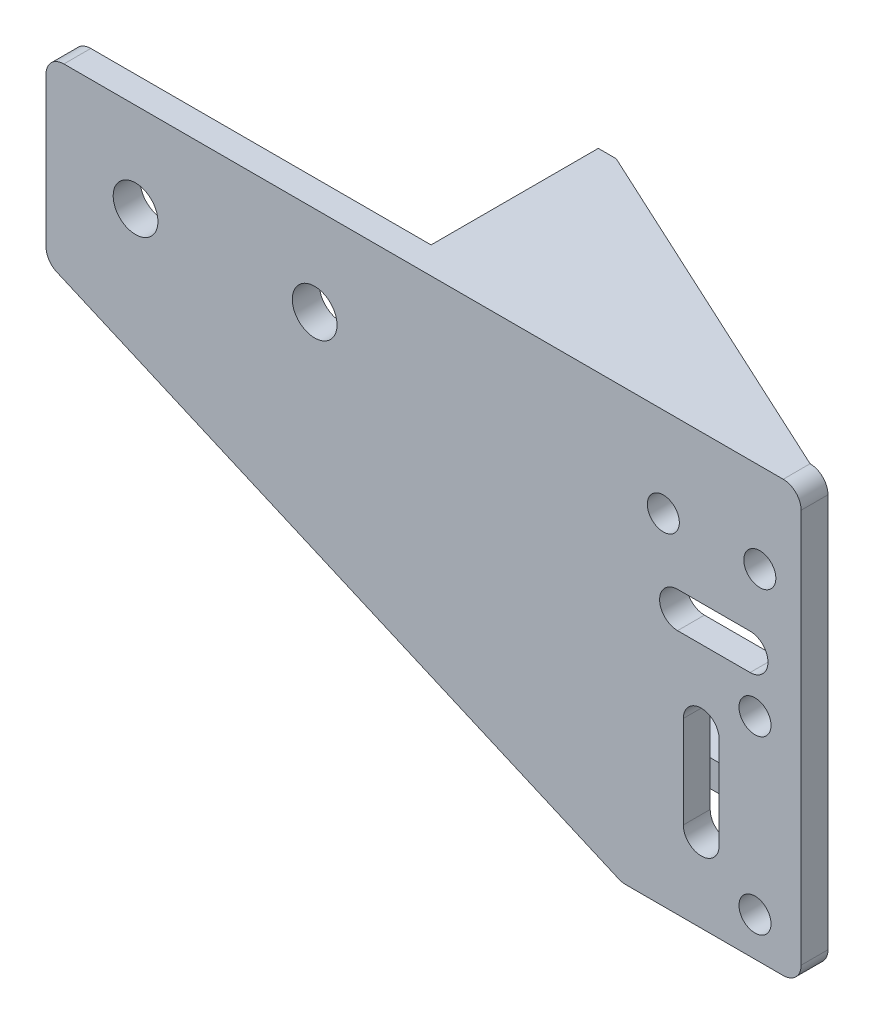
ISO-10303-21;
HEADER;
FILE_DESCRIPTION(('STEP AP214'),'2;1');
FILE_NAME('part.step','',(''),(''),'','','');
FILE_SCHEMA(('AUTOMOTIVE_DESIGN { 1 0 10303 214 1 1 1 1 }'));
ENDSEC;
DATA;
#1=APPLICATION_CONTEXT('core data for automotive mechanical design processes');
#2=APPLICATION_PROTOCOL_DEFINITION('international standard','automotive_design',2000,#1);
#3=PRODUCT_CONTEXT('',#1,'mechanical');
#4=PRODUCT('Part','Part','',(#3));
#5=PRODUCT_RELATED_PRODUCT_CATEGORY('part','',(#4));
#6=PRODUCT_DEFINITION_FORMATION('','',#4);
#7=PRODUCT_DEFINITION_CONTEXT('part definition',#1,'design');
#8=PRODUCT_DEFINITION('design','',#6,#7);
#9=PRODUCT_DEFINITION_SHAPE('','',#8);
#10=(LENGTH_UNIT() NAMED_UNIT(*) SI_UNIT(.MILLI.,.METRE.));
#11=(NAMED_UNIT(*) PLANE_ANGLE_UNIT() SI_UNIT($,.RADIAN.));
#12=(NAMED_UNIT(*) SI_UNIT($,.STERADIAN.) SOLID_ANGLE_UNIT());
#13=UNCERTAINTY_MEASURE_WITH_UNIT(LENGTH_MEASURE(1.E-05),#10,'distance_accuracy_value','');
#14=(GEOMETRIC_REPRESENTATION_CONTEXT(3) GLOBAL_UNCERTAINTY_ASSIGNED_CONTEXT((#13)) GLOBAL_UNIT_ASSIGNED_CONTEXT((#10,
#11,#12)) REPRESENTATION_CONTEXT('',''));
#15=CARTESIAN_POINT('',(0.,0.,0.));
#16=DIRECTION('',(0.,0.,1.));
#17=DIRECTION('',(1.,0.,0.));
#18=AXIS2_PLACEMENT_3D('',#15,#16,#17);
#19=CARTESIAN_POINT('',(11.0000000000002,212.9125,-10.));
#20=DIRECTION('',(1.,0.,0.));
#21=DIRECTION('',(0.,0.,-1.));
#22=AXIS2_PLACEMENT_3D('',#19,#20,#21);
#23=CYLINDRICAL_SURFACE('',#22,2.5);
#24=CARTESIAN_POINT('',(20.,212.9125,-10.));
#25=DIRECTION('',(1.,0.,0.));
#26=DIRECTION('',(0.,0.,-1.));
#27=AXIS2_PLACEMENT_3D('',#24,#25,#26);
#28=CIRCLE('',#27,2.5);
#29=CARTESIAN_POINT('',(20.,212.9125,-12.5));
#30=VERTEX_POINT('',#29);
#31=EDGE_CURVE('E159',#30,#30,#28,.T.);
#32=ORIENTED_EDGE('',*,*,#31,.F.);
#33=EDGE_LOOP('',(#32));
#34=FACE_BOUND('',#33,.T.);
#35=CARTESIAN_POINT('',(22.,212.9125,-10.));
#36=DIRECTION('',(1.,0.,0.));
#37=DIRECTION('',(0.,0.,-1.));
#38=AXIS2_PLACEMENT_3D('',#35,#36,#37);
#39=CIRCLE('',#38,2.5);
#40=CARTESIAN_POINT('',(22.,212.9125,-12.5));
#41=VERTEX_POINT('',#40);
#42=EDGE_CURVE('E20',#41,#41,#39,.T.);
#43=ORIENTED_EDGE('',*,*,#42,.T.);
#44=EDGE_LOOP('',(#43));
#45=FACE_BOUND('',#44,.T.);
#46=ADVANCED_FACE('F17',(#34,#45),#23,.F.);
#47=CARTESIAN_POINT('',(0.,197.4125,0.));
#48=DIRECTION('',(0.,1.,0.));
#49=DIRECTION('',(0.,0.,1.));
#50=AXIS2_PLACEMENT_3D('',#47,#48,#49);
#51=PLANE('',#50);
#52=DIRECTION('',(-1.,0.,0.));
#53=VECTOR('',#52,1.);
#54=CARTESIAN_POINT('',(0.,197.4125,0.));
#55=LINE('',#54,#53);
#56=CARTESIAN_POINT('',(51.1699999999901,197.4125,0.));
#57=VERTEX_POINT('',#56);
#58=CARTESIAN_POINT('',(55.1699999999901,197.4125,0.));
#59=VERTEX_POINT('',#58);
#60=EDGE_CURVE('E288',#57,#59,#55,.F.);
#61=ORIENTED_EDGE('',*,*,#60,.T.);
#62=DIRECTION('',(1.,0.,0.));
#63=VECTOR('',#62,1.);
#64=CARTESIAN_POINT('',(0.,197.4125,0.));
#65=LINE('',#64,#63);
#66=CARTESIAN_POINT('',(62.3249999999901,197.4125,0.));
#67=VERTEX_POINT('',#66);
#68=EDGE_CURVE('E298',#59,#67,#65,.T.);
#69=ORIENTED_EDGE('',*,*,#68,.T.);
#70=DIRECTION('',(-0.90742527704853,0.,-0.420213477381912));
#71=VECTOR('',#70,1.);
#72=CARTESIAN_POINT('',(11.0053090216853,197.4125,-23.7652910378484));
#73=LINE('',#72,#71);
#74=CARTESIAN_POINT('',(22.,197.4125,-18.6738334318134));
#75=VERTEX_POINT('',#74);
#76=EDGE_CURVE('E376',#75,#67,#73,.F.);
#77=ORIENTED_EDGE('',*,*,#76,.F.);
#78=DIRECTION('',(0.,0.,1.));
#79=VECTOR('',#78,1.);
#80=CARTESIAN_POINT('',(22.,197.4125,0.));
#81=LINE('',#80,#79);
#82=CARTESIAN_POINT('',(22.,197.4125,0.));
#83=VERTEX_POINT('',#82);
#84=EDGE_CURVE('E375',#75,#83,#81,.T.);
#85=ORIENTED_EDGE('',*,*,#84,.T.);
#86=DIRECTION('',(1.,0.,0.));
#87=VECTOR('',#86,1.);
#88=CARTESIAN_POINT('',(0.,197.4125,0.));
#89=LINE('',#88,#87);
#90=EDGE_CURVE('E293',#83,#57,#89,.T.);
#91=ORIENTED_EDGE('',*,*,#90,.T.);
#92=EDGE_LOOP('',(#61,#69,#77,#85,#91));
#93=FACE_BOUND('',#92,.T.);
#94=ADVANCED_FACE('F485',(#93),#51,.T.);
#95=CARTESIAN_POINT('',(11.0053090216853,194.4125,-23.7652910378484));
#96=DIRECTION('',(0.420213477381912,0.,-0.90742527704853));
#97=DIRECTION('',(-0.90742527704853,0.,-0.420213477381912));
#98=AXIS2_PLACEMENT_3D('',#95,#96,#97);
#99=PLANE('',#98);
#100=ORIENTED_EDGE('',*,*,#76,.T.);
#101=DIRECTION('',(0.,1.,0.));
#102=VECTOR('',#101,1.);
#103=CARTESIAN_POINT('',(62.3249999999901,0.,0.));
#104=LINE('',#103,#102);
#105=CARTESIAN_POINT('',(62.3249999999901,194.4125,0.));
#106=VERTEX_POINT('',#105);
#107=EDGE_CURVE('E306',#67,#106,#104,.F.);
#108=ORIENTED_EDGE('',*,*,#107,.T.);
#109=DIRECTION('',(-0.907425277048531,0.,-0.42021347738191));
#110=VECTOR('',#109,1.);
#111=CARTESIAN_POINT('',(62.3249999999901,194.4125,0.));
#112=LINE('',#111,#110);
#113=CARTESIAN_POINT('',(22.,194.4125,-18.6738334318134));
#114=VERTEX_POINT('',#113);
#115=EDGE_CURVE('E372',#106,#114,#112,.T.);
#116=ORIENTED_EDGE('',*,*,#115,.T.);
#117=DIRECTION('',(0.,1.,0.));
#118=VECTOR('',#117,1.);
#119=CARTESIAN_POINT('',(22.,0.,-18.6738334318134));
#120=LINE('',#119,#118);
#121=EDGE_CURVE('E345',#75,#114,#120,.F.);
#122=ORIENTED_EDGE('',*,*,#121,.F.);
#123=EDGE_LOOP('',(#100,#108,#116,#122));
#124=FACE_BOUND('',#123,.T.);
#125=ADVANCED_FACE('F540',(#124),#99,.T.);
#126=CARTESIAN_POINT('',(0.,194.4125,0.));
#127=DIRECTION('',(0.,1.,0.));
#128=DIRECTION('',(0.,0.,1.));
#129=AXIS2_PLACEMENT_3D('',#126,#127,#128);
#130=PLANE('',#129);
#131=ORIENTED_EDGE('',*,*,#115,.F.);
#132=DIRECTION('',(1.,0.,0.));
#133=VECTOR('',#132,1.);
#134=CARTESIAN_POINT('',(0.,194.4125,0.));
#135=LINE('',#134,#133);
#136=CARTESIAN_POINT('',(55.1699999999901,194.4125,0.));
#137=VERTEX_POINT('',#136);
#138=EDGE_CURVE('E279',#106,#137,#135,.F.);
#139=ORIENTED_EDGE('',*,*,#138,.T.);
#140=DIRECTION('',(-1.,0.,0.));
#141=VECTOR('',#140,1.);
#142=CARTESIAN_POINT('',(0.,194.4125,0.));
#143=LINE('',#142,#141);
#144=CARTESIAN_POINT('',(51.1699999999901,194.4125,0.));
#145=VERTEX_POINT('',#144);
#146=EDGE_CURVE('E158',#137,#145,#143,.T.);
#147=ORIENTED_EDGE('',*,*,#146,.T.);
#148=DIRECTION('',(1.,0.,0.));
#149=VECTOR('',#148,1.);
#150=CARTESIAN_POINT('',(0.,194.4125,0.));
#151=LINE('',#150,#149);
#152=CARTESIAN_POINT('',(20.,194.4125,0.));
#153=VERTEX_POINT('',#152);
#154=EDGE_CURVE('E275',#145,#153,#151,.F.);
#155=ORIENTED_EDGE('',*,*,#154,.T.);
#156=DIRECTION('',(0.,0.,1.));
#157=VECTOR('',#156,1.);
#158=CARTESIAN_POINT('',(20.,194.4125,0.));
#159=LINE('',#158,#157);
#160=CARTESIAN_POINT('',(20.,194.4125,-18.6738334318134));
#161=VERTEX_POINT('',#160);
#162=EDGE_CURVE('E344',#161,#153,#159,.T.);
#163=ORIENTED_EDGE('',*,*,#162,.F.);
#164=DIRECTION('',(-1.,0.,0.));
#165=VECTOR('',#164,1.);
#166=CARTESIAN_POINT('',(0.,194.4125,-18.6738334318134));
#167=LINE('',#166,#165);
#168=EDGE_CURVE('E356',#114,#161,#167,.T.);
#169=ORIENTED_EDGE('',*,*,#168,.F.);
#170=EDGE_LOOP('',(#131,#139,#147,#155,#163,#169));
#171=FACE_BOUND('',#170,.T.);
#172=ADVANCED_FACE('F549',(#171),#130,.F.);
#173=CARTESIAN_POINT('',(0.,228.4125,0.));
#174=DIRECTION('',(0.,1.,0.));
#175=DIRECTION('',(0.,0.,1.));
#176=AXIS2_PLACEMENT_3D('',#173,#174,#175);
#177=PLANE('',#176);
#178=DIRECTION('',(-0.90742527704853,0.,-0.420213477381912));
#179=VECTOR('',#178,1.);
#180=CARTESIAN_POINT('',(11.0053090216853,228.4125,-23.7652910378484));
#181=LINE('',#180,#179);
#182=CARTESIAN_POINT('',(62.3249999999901,228.4125,0.));
#183=VERTEX_POINT('',#182);
#184=CARTESIAN_POINT('',(22.,228.4125,-18.6738334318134));
#185=VERTEX_POINT('',#184);
#186=EDGE_CURVE('E359',#183,#185,#181,.T.);
#187=ORIENTED_EDGE('',*,*,#186,.F.);
#188=DIRECTION('',(1.,0.,0.));
#189=VECTOR('',#188,1.);
#190=CARTESIAN_POINT('',(0.,228.4125,0.));
#191=LINE('',#190,#189);
#192=CARTESIAN_POINT('',(22.,228.4125,0.));
#193=VERTEX_POINT('',#192);
#194=EDGE_CURVE('E253',#183,#193,#191,.F.);
#195=ORIENTED_EDGE('',*,*,#194,.T.);
#196=DIRECTION('',(0.,0.,1.));
#197=VECTOR('',#196,1.);
#198=CARTESIAN_POINT('',(22.,228.4125,0.));
#199=LINE('',#198,#197);
#200=EDGE_CURVE('E393',#193,#185,#199,.F.);
#201=ORIENTED_EDGE('',*,*,#200,.T.);
#202=EDGE_LOOP('',(#187,#195,#201));
#203=FACE_BOUND('',#202,.T.);
#204=ADVANCED_FACE('F493',(#203),#177,.F.);
#205=CARTESIAN_POINT('',(22.,0.,0.));
#206=DIRECTION('',(-1.,0.,0.));
#207=DIRECTION('',(0.,0.,1.));
#208=AXIS2_PLACEMENT_3D('',#205,#206,#207);
#209=PLANE('',#208);
#210=ORIENTED_EDGE('',*,*,#42,.F.);
#211=EDGE_LOOP('',(#210));
#212=FACE_BOUND('',#211,.T.);
#213=ORIENTED_EDGE('',*,*,#200,.F.);
#214=DIRECTION('',(0.,1.,0.));
#215=VECTOR('',#214,1.);
#216=CARTESIAN_POINT('',(22.,0.,0.));
#217=LINE('',#216,#215);
#218=EDGE_CURVE('E318',#193,#83,#217,.F.);
#219=ORIENTED_EDGE('',*,*,#218,.T.);
#220=ORIENTED_EDGE('',*,*,#84,.F.);
#221=DIRECTION('',(0.,1.,0.));
#222=VECTOR('',#221,1.);
#223=CARTESIAN_POINT('',(22.,0.,-18.6738334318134));
#224=LINE('',#223,#222);
#225=EDGE_CURVE('E355',#185,#75,#224,.F.);
#226=ORIENTED_EDGE('',*,*,#225,.F.);
#227=EDGE_LOOP('',(#213,#219,#220,#226));
#228=FACE_BOUND('',#227,.T.);
#229=ADVANCED_FACE('F489',(#212,#228),#209,.F.);
#230=CARTESIAN_POINT('',(11.0053090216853,228.4125,-23.7652910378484));
#231=DIRECTION('',(0.420213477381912,0.,-0.90742527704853));
#232=DIRECTION('',(-0.90742527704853,0.,-0.420213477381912));
#233=AXIS2_PLACEMENT_3D('',#230,#231,#232);
#234=PLANE('',#233);
#235=DIRECTION('',(-0.907425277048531,0.,-0.42021347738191));
#236=VECTOR('',#235,1.);
#237=CARTESIAN_POINT('',(62.3249999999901,231.4125,0.));
#238=LINE('',#237,#236);
#239=CARTESIAN_POINT('',(62.3249999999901,231.4125,0.));
#240=VERTEX_POINT('',#239);
#241=CARTESIAN_POINT('',(22.,231.4125,-18.6738334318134));
#242=VERTEX_POINT('',#241);
#243=EDGE_CURVE('E327',#240,#242,#238,.T.);
#244=ORIENTED_EDGE('',*,*,#243,.F.);
#245=DIRECTION('',(0.,1.,0.));
#246=VECTOR('',#245,1.);
#247=CARTESIAN_POINT('',(62.3249999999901,0.,0.));
#248=LINE('',#247,#246);
#249=EDGE_CURVE('E250',#240,#183,#248,.F.);
#250=ORIENTED_EDGE('',*,*,#249,.T.);
#251=ORIENTED_EDGE('',*,*,#186,.T.);
#252=DIRECTION('',(0.,1.,0.));
#253=VECTOR('',#252,1.);
#254=CARTESIAN_POINT('',(22.,0.,-18.6738334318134));
#255=LINE('',#254,#253);
#256=EDGE_CURVE('E352',#242,#185,#255,.F.);
#257=ORIENTED_EDGE('',*,*,#256,.F.);
#258=EDGE_LOOP('',(#244,#250,#251,#257));
#259=FACE_BOUND('',#258,.T.);
#260=ADVANCED_FACE('F492',(#259),#234,.T.);
#261=CARTESIAN_POINT('',(0.,0.,-18.6738334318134));
#262=DIRECTION('',(0.,0.,-1.));
#263=DIRECTION('',(-1.,0.,0.));
#264=AXIS2_PLACEMENT_3D('',#261,#262,#263);
#265=PLANE('',#264);
#266=ORIENTED_EDGE('',*,*,#225,.T.);
#267=ORIENTED_EDGE('',*,*,#121,.T.);
#268=ORIENTED_EDGE('',*,*,#168,.T.);
#269=DIRECTION('',(0.,1.,0.));
#270=VECTOR('',#269,1.);
#271=CARTESIAN_POINT('',(20.,228.4125,-18.6738334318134));
#272=LINE('',#271,#270);
#273=CARTESIAN_POINT('',(20.,231.4125,-18.6738334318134));
#274=VERTEX_POINT('',#273);
#275=EDGE_CURVE('E341',#274,#161,#272,.F.);
#276=ORIENTED_EDGE('',*,*,#275,.F.);
#277=DIRECTION('',(1.,0.,0.));
#278=VECTOR('',#277,1.);
#279=CARTESIAN_POINT('',(0.,231.4125,-18.6738334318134));
#280=LINE('',#279,#278);
#281=EDGE_CURVE('E330',#242,#274,#280,.F.);
#282=ORIENTED_EDGE('',*,*,#281,.F.);
#283=ORIENTED_EDGE('',*,*,#256,.T.);
#284=EDGE_LOOP('',(#266,#267,#268,#276,#282,#283));
#285=FACE_BOUND('',#284,.T.);
#286=ADVANCED_FACE('F544',(#285),#265,.T.);
#287=CARTESIAN_POINT('',(20.,228.4125,0.));
#288=DIRECTION('',(-1.,0.,0.));
#289=DIRECTION('',(0.,0.,1.));
#290=AXIS2_PLACEMENT_3D('',#287,#288,#289);
#291=PLANE('',#290);
#292=ORIENTED_EDGE('',*,*,#31,.T.);
#293=EDGE_LOOP('',(#292));
#294=FACE_BOUND('',#293,.T.);
#295=ORIENTED_EDGE('',*,*,#162,.T.);
#296=DIRECTION('',(0.,1.,0.));
#297=VECTOR('',#296,1.);
#298=CARTESIAN_POINT('',(20.,0.,0.));
#299=LINE('',#298,#297);
#300=CARTESIAN_POINT('',(20.,231.4125,0.));
#301=VERTEX_POINT('',#300);
#302=EDGE_CURVE('E278',#153,#301,#299,.T.);
#303=ORIENTED_EDGE('',*,*,#302,.T.);
#304=DIRECTION('',(0.,0.,1.));
#305=VECTOR('',#304,1.);
#306=CARTESIAN_POINT('',(20.,231.4125,3.));
#307=LINE('',#306,#305);
#308=EDGE_CURVE('E324',#274,#301,#307,.T.);
#309=ORIENTED_EDGE('',*,*,#308,.F.);
#310=ORIENTED_EDGE('',*,*,#275,.T.);
#311=EDGE_LOOP('',(#295,#303,#309,#310));
#312=FACE_BOUND('',#311,.T.);
#313=ADVANCED_FACE('F480',(#294,#312),#291,.T.);
#314=CARTESIAN_POINT('',(44.7414192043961,185.4125,3.));
#315=DIRECTION('',(0.,0.,-1.));
#316=DIRECTION('',(-1.,0.,0.));
#317=AXIS2_PLACEMENT_3D('',#314,#315,#316);
#318=CYLINDRICAL_SURFACE('',#317,2.);
#319=CARTESIAN_POINT('',(44.7414192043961,185.4125,0.));
#320=DIRECTION('',(0.,0.,-1.));
#321=DIRECTION('',(-1.,0.,0.));
#322=AXIS2_PLACEMENT_3D('',#319,#320,#321);
#323=CIRCLE('',#322,2.);
#324=CARTESIAN_POINT('',(43.9431852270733,183.578699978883,0.));
#325=VERTEX_POINT('',#324);
#326=CARTESIAN_POINT('',(44.7414192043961,183.4125,0.));
#327=VERTEX_POINT('',#326);
#328=EDGE_CURVE('E254',#325,#327,#323,.F.);
#329=ORIENTED_EDGE('',*,*,#328,.T.);
#330=DIRECTION('',(0.,0.,1.));
#331=VECTOR('',#330,1.);
#332=CARTESIAN_POINT('',(44.7414192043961,183.4125,3.));
#333=LINE('',#332,#331);
#334=CARTESIAN_POINT('',(44.7414192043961,183.4125,3.));
#335=VERTEX_POINT('',#334);
#336=EDGE_CURVE('E156',#327,#335,#333,.T.);
#337=ORIENTED_EDGE('',*,*,#336,.T.);
#338=CARTESIAN_POINT('',(44.7414192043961,185.4125,3.));
#339=DIRECTION('',(0.,0.,-1.));
#340=DIRECTION('',(-1.,0.,0.));
#341=AXIS2_PLACEMENT_3D('',#338,#339,#340);
#342=CIRCLE('',#341,2.);
#343=CARTESIAN_POINT('',(43.9431852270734,183.578699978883,3.));
#344=VERTEX_POINT('',#343);
#345=EDGE_CURVE('E148',#335,#344,#342,.T.);
#346=ORIENTED_EDGE('',*,*,#345,.T.);
#347=DIRECTION('',(0.,0.,1.));
#348=VECTOR('',#347,1.);
#349=CARTESIAN_POINT('',(43.9431852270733,183.578699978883,3.));
#350=LINE('',#349,#348);
#351=EDGE_CURVE('E153',#344,#325,#350,.F.);
#352=ORIENTED_EDGE('',*,*,#351,.T.);
#353=EDGE_LOOP('',(#329,#337,#346,#352));
#354=FACE_BOUND('',#353,.T.);
#355=ADVANCED_FACE('F152',(#354),#318,.T.);
#356=CARTESIAN_POINT('',(0.,194.4125,0.));
#357=DIRECTION('',(0.,0.,-1.));
#358=DIRECTION('',(-1.,0.,0.));
#359=AXIS2_PLACEMENT_3D('',#356,#357,#358);
#360=PLANE('',#359);
#361=DIRECTION('',(0.,-1.,0.));
#362=VECTOR('',#361,1.);
#363=CARTESIAN_POINT('',(51.1699999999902,0.,0.));
#364=LINE('',#363,#362);
#365=EDGE_CURVE('E269',#57,#145,#364,.T.);
#366=ORIENTED_EDGE('',*,*,#365,.T.);
#367=ORIENTED_EDGE('',*,*,#146,.F.);
#368=DIRECTION('',(0.,-1.,0.));
#369=VECTOR('',#368,1.);
#370=CARTESIAN_POINT('',(55.1699999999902,0.,0.));
#371=LINE('',#370,#369);
#372=EDGE_CURVE('E262',#59,#137,#371,.T.);
#373=ORIENTED_EDGE('',*,*,#372,.F.);
#374=ORIENTED_EDGE('',*,*,#60,.F.);
#375=EDGE_LOOP('',(#366,#367,#373,#374));
#376=FACE_BOUND('',#375,.T.);
#377=ADVANCED_FACE('F655',(#376),#360,.F.);
#378=CARTESIAN_POINT('',(0.,0.,0.));
#379=DIRECTION('',(0.,0.,1.));
#380=DIRECTION('',(1.,0.,0.));
#381=AXIS2_PLACEMENT_3D('',#378,#379,#380);
#382=PLANE('',#381);
#383=DIRECTION('',(1.,0.,0.));
#384=VECTOR('',#383,1.);
#385=CARTESIAN_POINT('',(0.,210.87,0.));
#386=LINE('',#385,#384);
#387=CARTESIAN_POINT('',(58.6249999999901,210.87,0.));
#388=VERTEX_POINT('',#387);
#389=CARTESIAN_POINT('',(50.5249999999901,210.87,0.));
#390=VERTEX_POINT('',#389);
#391=EDGE_CURVE('E204',#388,#390,#386,.F.);
#392=ORIENTED_EDGE('',*,*,#391,.F.);
#393=CARTESIAN_POINT('',(58.6249999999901,212.87,0.));
#394=DIRECTION('',(0.,0.,1.));
#395=DIRECTION('',(1.,0.,0.));
#396=AXIS2_PLACEMENT_3D('',#393,#394,#395);
#397=CIRCLE('',#396,2.);
#398=CARTESIAN_POINT('',(58.6249999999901,214.87,0.));
#399=VERTEX_POINT('',#398);
#400=EDGE_CURVE('E193',#388,#399,#397,.T.);
#401=ORIENTED_EDGE('',*,*,#400,.T.);
#402=DIRECTION('',(1.,0.,0.));
#403=VECTOR('',#402,1.);
#404=CARTESIAN_POINT('',(0.,214.87,0.));
#405=LINE('',#404,#403);
#406=CARTESIAN_POINT('',(50.5249999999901,214.87,0.));
#407=VERTEX_POINT('',#406);
#408=EDGE_CURVE('E200',#399,#407,#405,.F.);
#409=ORIENTED_EDGE('',*,*,#408,.T.);
#410=CARTESIAN_POINT('',(50.5249999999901,212.87,0.));
#411=DIRECTION('',(0.,0.,1.));
#412=DIRECTION('',(1.,0.,0.));
#413=AXIS2_PLACEMENT_3D('',#410,#411,#412);
#414=CIRCLE('',#413,2.);
#415=EDGE_CURVE('E203',#407,#390,#414,.T.);
#416=ORIENTED_EDGE('',*,*,#415,.T.);
#417=EDGE_LOOP('',(#392,#401,#409,#416));
#418=FACE_BOUND('',#417,.T.);
#419=CARTESIAN_POINT('',(59.1724999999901,187.7375,0.));
#420=DIRECTION('',(0.,0.,-1.));
#421=DIRECTION('',(-1.,0.,0.));
#422=AXIS2_PLACEMENT_3D('',#419,#420,#421);
#423=CIRCLE('',#422,1.7875);
#424=CARTESIAN_POINT('',(57.3849999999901,187.7375,0.));
#425=VERTEX_POINT('',#424);
#426=EDGE_CURVE('E263',#425,#425,#423,.F.);
#427=ORIENTED_EDGE('',*,*,#426,.T.);
#428=EDGE_LOOP('',(#427));
#429=FACE_BOUND('',#428,.T.);
#430=CARTESIAN_POINT('',(59.1724999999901,206.9125,0.));
#431=DIRECTION('',(0.,0.,-1.));
#432=DIRECTION('',(-1.,0.,0.));
#433=AXIS2_PLACEMENT_3D('',#430,#431,#432);
#434=CIRCLE('',#433,1.7875);
#435=CARTESIAN_POINT('',(57.3849999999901,206.9125,0.));
#436=VERTEX_POINT('',#435);
#437=EDGE_CURVE('E457',#436,#436,#434,.F.);
#438=ORIENTED_EDGE('',*,*,#437,.T.);
#439=EDGE_LOOP('',(#438));
#440=FACE_BOUND('',#439,.T.);
#441=CARTESIAN_POINT('',(59.7124999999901,221.4125,0.));
#442=DIRECTION('',(0.,0.,-1.));
#443=DIRECTION('',(-1.,0.,0.));
#444=AXIS2_PLACEMENT_3D('',#441,#442,#443);
#445=CIRCLE('',#444,1.7875);
#446=CARTESIAN_POINT('',(57.9249999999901,221.4125,0.));
#447=VERTEX_POINT('',#446);
#448=EDGE_CURVE('E460',#447,#447,#445,.F.);
#449=ORIENTED_EDGE('',*,*,#448,.T.);
#450=EDGE_LOOP('',(#449));
#451=FACE_BOUND('',#450,.T.);
#452=CARTESIAN_POINT('',(48.9374999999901,221.4125,0.));
#453=DIRECTION('',(0.,0.,-1.));
#454=DIRECTION('',(-1.,0.,0.));
#455=AXIS2_PLACEMENT_3D('',#452,#453,#454);
#456=CIRCLE('',#455,1.7875);
#457=CARTESIAN_POINT('',(47.1499999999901,221.4125,0.));
#458=VERTEX_POINT('',#457);
#459=EDGE_CURVE('E463',#458,#458,#456,.F.);
#460=ORIENTED_EDGE('',*,*,#459,.T.);
#461=EDGE_LOOP('',(#460));
#462=FACE_BOUND('',#461,.T.);
#463=CARTESIAN_POINT('',(-9.99999999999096,221.4125,0.));
#464=DIRECTION('',(0.,0.,-1.));
#465=DIRECTION('',(-1.,0.,0.));
#466=AXIS2_PLACEMENT_3D('',#463,#464,#465);
#467=CIRCLE('',#466,2.5);
#468=CARTESIAN_POINT('',(-12.499999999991,221.4125,0.));
#469=VERTEX_POINT('',#468);
#470=EDGE_CURVE('E466',#469,#469,#467,.F.);
#471=ORIENTED_EDGE('',*,*,#470,.T.);
#472=EDGE_LOOP('',(#471));
#473=FACE_BOUND('',#472,.T.);
#474=CARTESIAN_POINT('',(9.99999999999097,221.4125,0.));
#475=DIRECTION('',(0.,0.,-1.));
#476=DIRECTION('',(-1.,0.,0.));
#477=AXIS2_PLACEMENT_3D('',#474,#475,#476);
#478=CIRCLE('',#477,2.5);
#479=CARTESIAN_POINT('',(7.49999999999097,221.4125,0.));
#480=VERTEX_POINT('',#479);
#481=EDGE_CURVE('E221',#480,#480,#478,.F.);
#482=ORIENTED_EDGE('',*,*,#481,.T.);
#483=EDGE_LOOP('',(#482));
#484=FACE_BOUND('',#483,.T.);
#485=ORIENTED_EDGE('',*,*,#194,.F.);
#486=ORIENTED_EDGE('',*,*,#249,.F.);
#487=CARTESIAN_POINT('',(62.3249999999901,229.4125,0.));
#488=DIRECTION('',(0.,0.,-1.));
#489=DIRECTION('',(-1.,0.,0.));
#490=AXIS2_PLACEMENT_3D('',#487,#488,#489);
#491=CIRCLE('',#490,2.);
#492=CARTESIAN_POINT('',(64.3249999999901,229.4125,0.));
#493=VERTEX_POINT('',#492);
#494=EDGE_CURVE('E248',#493,#240,#491,.F.);
#495=ORIENTED_EDGE('',*,*,#494,.F.);
#496=DIRECTION('',(0.,1.,0.));
#497=VECTOR('',#496,1.);
#498=CARTESIAN_POINT('',(64.3249999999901,0.,0.));
#499=LINE('',#498,#497);
#500=CARTESIAN_POINT('',(64.3249999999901,185.4125,0.));
#501=VERTEX_POINT('',#500);
#502=EDGE_CURVE('E249',#501,#493,#499,.T.);
#503=ORIENTED_EDGE('',*,*,#502,.F.);
#504=CARTESIAN_POINT('',(62.3249999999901,185.4125,0.));
#505=DIRECTION('',(0.,0.,1.));
#506=DIRECTION('',(1.,0.,0.));
#507=AXIS2_PLACEMENT_3D('',#504,#505,#506);
#508=CIRCLE('',#507,2.);
#509=CARTESIAN_POINT('',(62.3249999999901,183.4125,0.));
#510=VERTEX_POINT('',#509);
#511=EDGE_CURVE('E222',#510,#501,#508,.T.);
#512=ORIENTED_EDGE('',*,*,#511,.F.);
#513=DIRECTION('',(1.,0.,0.));
#514=VECTOR('',#513,1.);
#515=CARTESIAN_POINT('',(0.,183.4125,0.));
#516=LINE('',#515,#514);
#517=EDGE_CURVE('E227',#510,#327,#516,.F.);
#518=ORIENTED_EDGE('',*,*,#517,.T.);
#519=ORIENTED_EDGE('',*,*,#328,.F.);
#520=DIRECTION('',(-0.916900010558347,0.399116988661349,0.));
#521=VECTOR('',#520,1.);
#522=CARTESIAN_POINT('',(74.1805954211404,170.416671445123,0.));
#523=LINE('',#522,#521);
#524=CARTESIAN_POINT('',(-18.7982339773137,210.889383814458,0.));
#525=VERTEX_POINT('',#524);
#526=EDGE_CURVE('E169',#325,#525,#523,.T.);
#527=ORIENTED_EDGE('',*,*,#526,.T.);
#528=CARTESIAN_POINT('',(-17.999999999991,212.723183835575,0.));
#529=DIRECTION('',(0.,0.,1.));
#530=DIRECTION('',(1.,0.,0.));
#531=AXIS2_PLACEMENT_3D('',#528,#529,#530);
#532=CIRCLE('',#531,2.);
#533=CARTESIAN_POINT('',(-19.9999999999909,212.723183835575,0.));
#534=VERTEX_POINT('',#533);
#535=EDGE_CURVE('E228',#534,#525,#532,.T.);
#536=ORIENTED_EDGE('',*,*,#535,.F.);
#537=DIRECTION('',(0.,1.,0.));
#538=VECTOR('',#537,1.);
#539=CARTESIAN_POINT('',(-19.9999999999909,0.,0.));
#540=LINE('',#539,#538);
#541=CARTESIAN_POINT('',(-19.9999999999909,229.4125,0.));
#542=VERTEX_POINT('',#541);
#543=EDGE_CURVE('E233',#542,#534,#540,.F.);
#544=ORIENTED_EDGE('',*,*,#543,.F.);
#545=CARTESIAN_POINT('',(-17.999999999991,229.4125,0.));
#546=DIRECTION('',(0.,0.,-1.));
#547=DIRECTION('',(-1.,0.,0.));
#548=AXIS2_PLACEMENT_3D('',#545,#546,#547);
#549=CIRCLE('',#548,2.);
#550=CARTESIAN_POINT('',(-17.999999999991,231.4125,0.));
#551=VERTEX_POINT('',#550);
#552=EDGE_CURVE('E237',#551,#542,#549,.F.);
#553=ORIENTED_EDGE('',*,*,#552,.F.);
#554=DIRECTION('',(1.,0.,0.));
#555=VECTOR('',#554,1.);
#556=CARTESIAN_POINT('',(0.,231.4125,0.));
#557=LINE('',#556,#555);
#558=EDGE_CURVE('E244',#301,#551,#557,.F.);
#559=ORIENTED_EDGE('',*,*,#558,.F.);
#560=ORIENTED_EDGE('',*,*,#302,.F.);
#561=ORIENTED_EDGE('',*,*,#154,.F.);
#562=DIRECTION('',(0.,-1.,0.));
#563=VECTOR('',#562,1.);
#564=CARTESIAN_POINT('',(51.1699999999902,0.,0.));
#565=LINE('',#564,#563);
#566=CARTESIAN_POINT('',(51.1699999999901,192.4,0.));
#567=VERTEX_POINT('',#566);
#568=EDGE_CURVE('E213',#145,#567,#565,.T.);
#569=ORIENTED_EDGE('',*,*,#568,.T.);
#570=CARTESIAN_POINT('',(53.16999999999,192.4,0.));
#571=DIRECTION('',(0.,0.,1.));
#572=DIRECTION('',(1.,0.,0.));
#573=AXIS2_PLACEMENT_3D('',#570,#571,#572);
#574=CIRCLE('',#573,2.);
#575=CARTESIAN_POINT('',(55.16999999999,192.4,0.));
#576=VERTEX_POINT('',#575);
#577=EDGE_CURVE('E216',#567,#576,#574,.T.);
#578=ORIENTED_EDGE('',*,*,#577,.T.);
#579=DIRECTION('',(0.,-1.,0.));
#580=VECTOR('',#579,1.);
#581=CARTESIAN_POINT('',(55.1699999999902,0.,0.));
#582=LINE('',#581,#580);
#583=EDGE_CURVE('E217',#137,#576,#582,.T.);
#584=ORIENTED_EDGE('',*,*,#583,.F.);
#585=ORIENTED_EDGE('',*,*,#138,.F.);
#586=ORIENTED_EDGE('',*,*,#107,.F.);
#587=ORIENTED_EDGE('',*,*,#68,.F.);
#588=DIRECTION('',(0.,-1.,0.));
#589=VECTOR('',#588,1.);
#590=CARTESIAN_POINT('',(55.1699999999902,0.,0.));
#591=LINE('',#590,#589);
#592=CARTESIAN_POINT('',(55.16999999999,202.7,0.));
#593=VERTEX_POINT('',#592);
#594=EDGE_CURVE('E259',#593,#59,#591,.T.);
#595=ORIENTED_EDGE('',*,*,#594,.F.);
#596=CARTESIAN_POINT('',(53.16999999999,202.7,0.));
#597=DIRECTION('',(0.,0.,1.));
#598=DIRECTION('',(1.,0.,0.));
#599=AXIS2_PLACEMENT_3D('',#596,#597,#598);
#600=CIRCLE('',#599,2.);
#601=CARTESIAN_POINT('',(51.16999999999,202.7,0.));
#602=VERTEX_POINT('',#601);
#603=EDGE_CURVE('E211',#593,#602,#600,.T.);
#604=ORIENTED_EDGE('',*,*,#603,.T.);
#605=DIRECTION('',(0.,-1.,0.));
#606=VECTOR('',#605,1.);
#607=CARTESIAN_POINT('',(51.1699999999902,0.,0.));
#608=LINE('',#607,#606);
#609=EDGE_CURVE('E266',#602,#57,#608,.T.);
#610=ORIENTED_EDGE('',*,*,#609,.T.);
#611=ORIENTED_EDGE('',*,*,#90,.F.);
#612=ORIENTED_EDGE('',*,*,#218,.F.);
#613=EDGE_LOOP('',(#485,#486,#495,#503,#512,#518,#519,#527,#536,#544,#553,#559,#560,#561,#569,
#578,#584,#585,#586,#587,#595,#604,#610,#611,#612));
#614=FACE_BOUND('',#613,.T.);
#615=ADVANCED_FACE('F508',(#418,#429,#440,#451,#462,#473,#484,#614),#382,.F.);
#616=CARTESIAN_POINT('',(64.3249999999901,0.,3.));
#617=DIRECTION('',(1.,0.,0.));
#618=DIRECTION('',(0.,0.,-1.));
#619=AXIS2_PLACEMENT_3D('',#616,#617,#618);
#620=PLANE('',#619);
#621=DIRECTION('',(0.,1.,0.));
#622=VECTOR('',#621,1.);
#623=CARTESIAN_POINT('',(64.3249999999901,0.,3.));
#624=LINE('',#623,#622);
#625=CARTESIAN_POINT('',(64.3249999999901,185.4125,3.));
#626=VERTEX_POINT('',#625);
#627=CARTESIAN_POINT('',(64.3249999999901,229.4125,3.));
#628=VERTEX_POINT('',#627);
#629=EDGE_CURVE('E190',#626,#628,#624,.T.);
#630=ORIENTED_EDGE('',*,*,#629,.F.);
#631=DIRECTION('',(0.,0.,1.));
#632=VECTOR('',#631,1.);
#633=CARTESIAN_POINT('',(64.3249999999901,185.4125,3.));
#634=LINE('',#633,#632);
#635=EDGE_CURVE('E218',#501,#626,#634,.T.);
#636=ORIENTED_EDGE('',*,*,#635,.F.);
#637=ORIENTED_EDGE('',*,*,#502,.T.);
#638=DIRECTION('',(0.,0.,-1.));
#639=VECTOR('',#638,1.);
#640=CARTESIAN_POINT('',(64.3249999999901,229.4125,3.));
#641=LINE('',#640,#639);
#642=EDGE_CURVE('E245',#628,#493,#641,.T.);
#643=ORIENTED_EDGE('',*,*,#642,.F.);
#644=EDGE_LOOP('',(#630,#636,#637,#643));
#645=FACE_BOUND('',#644,.T.);
#646=ADVANCED_FACE('F648',(#645),#620,.T.);
#647=CARTESIAN_POINT('',(62.3249999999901,229.4125,3.));
#648=DIRECTION('',(0.,0.,-1.));
#649=DIRECTION('',(-1.,0.,0.));
#650=AXIS2_PLACEMENT_3D('',#647,#648,#649);
#651=CYLINDRICAL_SURFACE('',#650,2.);
#652=ORIENTED_EDGE('',*,*,#494,.T.);
#653=DIRECTION('',(0.,0.,1.));
#654=VECTOR('',#653,1.);
#655=CARTESIAN_POINT('',(62.3249999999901,231.4125,3.));
#656=LINE('',#655,#654);
#657=CARTESIAN_POINT('',(62.3249999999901,231.4125,3.));
#658=VERTEX_POINT('',#657);
#659=EDGE_CURVE('E241',#658,#240,#656,.F.);
#660=ORIENTED_EDGE('',*,*,#659,.F.);
#661=CARTESIAN_POINT('',(62.3249999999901,229.4125,3.));
#662=DIRECTION('',(0.,0.,-1.));
#663=DIRECTION('',(-1.,0.,0.));
#664=AXIS2_PLACEMENT_3D('',#661,#662,#663);
#665=CIRCLE('',#664,2.);
#666=EDGE_CURVE('E189',#628,#658,#665,.F.);
#667=ORIENTED_EDGE('',*,*,#666,.F.);
#668=ORIENTED_EDGE('',*,*,#642,.T.);
#669=EDGE_LOOP('',(#652,#660,#667,#668));
#670=FACE_BOUND('',#669,.T.);
#671=ADVANCED_FACE('F644',(#670),#651,.T.);
#672=CARTESIAN_POINT('',(0.,231.4125,3.));
#673=DIRECTION('',(0.,1.,0.));
#674=DIRECTION('',(0.,0.,1.));
#675=AXIS2_PLACEMENT_3D('',#672,#673,#674);
#676=PLANE('',#675);
#677=DIRECTION('',(1.,0.,0.));
#678=VECTOR('',#677,1.);
#679=CARTESIAN_POINT('',(0.,231.4125,3.));
#680=LINE('',#679,#678);
#681=CARTESIAN_POINT('',(-17.999999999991,231.4125,3.));
#682=VERTEX_POINT('',#681);
#683=EDGE_CURVE('E186',#658,#682,#680,.F.);
#684=ORIENTED_EDGE('',*,*,#683,.F.);
#685=ORIENTED_EDGE('',*,*,#659,.T.);
#686=ORIENTED_EDGE('',*,*,#243,.T.);
#687=ORIENTED_EDGE('',*,*,#281,.T.);
#688=ORIENTED_EDGE('',*,*,#308,.T.);
#689=ORIENTED_EDGE('',*,*,#558,.T.);
#690=DIRECTION('',(0.,0.,-1.));
#691=VECTOR('',#690,1.);
#692=CARTESIAN_POINT('',(-17.999999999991,231.4125,3.));
#693=LINE('',#692,#691);
#694=EDGE_CURVE('E238',#682,#551,#693,.T.);
#695=ORIENTED_EDGE('',*,*,#694,.F.);
#696=EDGE_LOOP('',(#684,#685,#686,#687,#688,#689,#695));
#697=FACE_BOUND('',#696,.T.);
#698=ADVANCED_FACE('F640',(#697),#676,.T.);
#699=CARTESIAN_POINT('',(-17.999999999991,229.4125,3.));
#700=DIRECTION('',(0.,0.,-1.));
#701=DIRECTION('',(-1.,0.,0.));
#702=AXIS2_PLACEMENT_3D('',#699,#700,#701);
#703=CYLINDRICAL_SURFACE('',#702,2.);
#704=ORIENTED_EDGE('',*,*,#552,.T.);
#705=DIRECTION('',(0.,0.,1.));
#706=VECTOR('',#705,1.);
#707=CARTESIAN_POINT('',(-19.9999999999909,229.4125,3.));
#708=LINE('',#707,#706);
#709=CARTESIAN_POINT('',(-19.9999999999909,229.4125,3.));
#710=VERTEX_POINT('',#709);
#711=EDGE_CURVE('E234',#710,#542,#708,.F.);
#712=ORIENTED_EDGE('',*,*,#711,.F.);
#713=CARTESIAN_POINT('',(-17.999999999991,229.4125,3.));
#714=DIRECTION('',(0.,0.,-1.));
#715=DIRECTION('',(-1.,0.,0.));
#716=AXIS2_PLACEMENT_3D('',#713,#714,#715);
#717=CIRCLE('',#716,2.);
#718=EDGE_CURVE('E185',#682,#710,#717,.F.);
#719=ORIENTED_EDGE('',*,*,#718,.F.);
#720=ORIENTED_EDGE('',*,*,#694,.T.);
#721=EDGE_LOOP('',(#704,#712,#719,#720));
#722=FACE_BOUND('',#721,.T.);
#723=ADVANCED_FACE('F636',(#722),#703,.T.);
#724=CARTESIAN_POINT('',(-19.9999999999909,0.,3.));
#725=DIRECTION('',(-1.,0.,0.));
#726=DIRECTION('',(0.,0.,1.));
#727=AXIS2_PLACEMENT_3D('',#724,#725,#726);
#728=PLANE('',#727);
#729=ORIENTED_EDGE('',*,*,#543,.T.);
#730=DIRECTION('',(0.,0.,1.));
#731=VECTOR('',#730,1.);
#732=CARTESIAN_POINT('',(-19.9999999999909,212.723183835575,3.));
#733=LINE('',#732,#731);
#734=CARTESIAN_POINT('',(-19.9999999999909,212.723183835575,3.));
#735=VERTEX_POINT('',#734);
#736=EDGE_CURVE('E230',#735,#534,#733,.F.);
#737=ORIENTED_EDGE('',*,*,#736,.F.);
#738=DIRECTION('',(0.,1.,0.));
#739=VECTOR('',#738,1.);
#740=CARTESIAN_POINT('',(-19.9999999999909,0.,3.));
#741=LINE('',#740,#739);
#742=EDGE_CURVE('E180',#710,#735,#741,.F.);
#743=ORIENTED_EDGE('',*,*,#742,.F.);
#744=ORIENTED_EDGE('',*,*,#711,.T.);
#745=EDGE_LOOP('',(#729,#737,#743,#744));
#746=FACE_BOUND('',#745,.T.);
#747=ADVANCED_FACE('F632',(#746),#728,.T.);
#748=CARTESIAN_POINT('',(-17.999999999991,212.723183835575,3.));
#749=DIRECTION('',(0.,0.,1.));
#750=DIRECTION('',(1.,0.,0.));
#751=AXIS2_PLACEMENT_3D('',#748,#749,#750);
#752=CYLINDRICAL_SURFACE('',#751,2.);
#753=ORIENTED_EDGE('',*,*,#535,.T.);
#754=DIRECTION('',(0.,0.,1.));
#755=VECTOR('',#754,1.);
#756=CARTESIAN_POINT('',(-18.7982339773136,210.889383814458,3.));
#757=LINE('',#756,#755);
#758=CARTESIAN_POINT('',(-18.7982339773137,210.889383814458,3.));
#759=VERTEX_POINT('',#758);
#760=EDGE_CURVE('E170',#525,#759,#757,.T.);
#761=ORIENTED_EDGE('',*,*,#760,.T.);
#762=CARTESIAN_POINT('',(-17.999999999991,212.723183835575,3.));
#763=DIRECTION('',(0.,0.,1.));
#764=DIRECTION('',(1.,0.,0.));
#765=AXIS2_PLACEMENT_3D('',#762,#763,#764);
#766=CIRCLE('',#765,2.);
#767=EDGE_CURVE('E175',#735,#759,#766,.T.);
#768=ORIENTED_EDGE('',*,*,#767,.F.);
#769=ORIENTED_EDGE('',*,*,#736,.T.);
#770=EDGE_LOOP('',(#753,#761,#768,#769));
#771=FACE_BOUND('',#770,.T.);
#772=ADVANCED_FACE('F629',(#771),#752,.T.);
#773=CARTESIAN_POINT('',(74.1805954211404,170.416671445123,3.));
#774=DIRECTION('',(0.399116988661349,0.916900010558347,0.));
#775=DIRECTION('',(-0.916900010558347,0.399116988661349,0.));
#776=AXIS2_PLACEMENT_3D('',#773,#774,#775);
#777=PLANE('',#776);
#778=ORIENTED_EDGE('',*,*,#351,.F.);
#779=DIRECTION('',(0.916900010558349,-0.399116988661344,0.));
#780=VECTOR('',#779,1.);
#781=CARTESIAN_POINT('',(-18.7982339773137,210.889383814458,3.));
#782=LINE('',#781,#780);
#783=EDGE_CURVE('E166',#759,#344,#782,.T.);
#784=ORIENTED_EDGE('',*,*,#783,.F.);
#785=ORIENTED_EDGE('',*,*,#760,.F.);
#786=ORIENTED_EDGE('',*,*,#526,.F.);
#787=EDGE_LOOP('',(#778,#784,#785,#786));
#788=FACE_BOUND('',#787,.T.);
#789=ADVANCED_FACE('F164',(#788),#777,.F.);
#790=CARTESIAN_POINT('',(0.,183.4125,3.));
#791=DIRECTION('',(0.,1.,0.));
#792=DIRECTION('',(0.,0.,1.));
#793=AXIS2_PLACEMENT_3D('',#790,#791,#792);
#794=PLANE('',#793);
#795=ORIENTED_EDGE('',*,*,#336,.F.);
#796=ORIENTED_EDGE('',*,*,#517,.F.);
#797=DIRECTION('',(0.,0.,1.));
#798=VECTOR('',#797,1.);
#799=CARTESIAN_POINT('',(62.3249999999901,183.4125,3.));
#800=LINE('',#799,#798);
#801=CARTESIAN_POINT('',(62.3249999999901,183.4125,3.));
#802=VERTEX_POINT('',#801);
#803=EDGE_CURVE('E223',#802,#510,#800,.F.);
#804=ORIENTED_EDGE('',*,*,#803,.F.);
#805=DIRECTION('',(1.,0.,0.));
#806=VECTOR('',#805,1.);
#807=CARTESIAN_POINT('',(0.,183.4125,3.));
#808=LINE('',#807,#806);
#809=EDGE_CURVE('E176',#335,#802,#808,.T.);
#810=ORIENTED_EDGE('',*,*,#809,.F.);
#811=EDGE_LOOP('',(#795,#796,#804,#810));
#812=FACE_BOUND('',#811,.T.);
#813=ADVANCED_FACE('F622',(#812),#794,.F.);
#814=CARTESIAN_POINT('',(62.3249999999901,185.4125,3.));
#815=DIRECTION('',(0.,0.,1.));
#816=DIRECTION('',(1.,0.,0.));
#817=AXIS2_PLACEMENT_3D('',#814,#815,#816);
#818=CYLINDRICAL_SURFACE('',#817,2.);
#819=ORIENTED_EDGE('',*,*,#511,.T.);
#820=ORIENTED_EDGE('',*,*,#635,.T.);
#821=CARTESIAN_POINT('',(62.3249999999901,185.4125,3.));
#822=DIRECTION('',(0.,0.,1.));
#823=DIRECTION('',(1.,0.,0.));
#824=AXIS2_PLACEMENT_3D('',#821,#822,#823);
#825=CIRCLE('',#824,2.);
#826=EDGE_CURVE('E178',#802,#626,#825,.T.);
#827=ORIENTED_EDGE('',*,*,#826,.F.);
#828=ORIENTED_EDGE('',*,*,#803,.T.);
#829=EDGE_LOOP('',(#819,#820,#827,#828));
#830=FACE_BOUND('',#829,.T.);
#831=ADVANCED_FACE('F618',(#830),#818,.T.);
#832=CARTESIAN_POINT('',(9.99999999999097,221.4125,3.));
#833=DIRECTION('',(0.,0.,-1.));
#834=DIRECTION('',(-1.,0.,0.));
#835=AXIS2_PLACEMENT_3D('',#832,#833,#834);
#836=CYLINDRICAL_SURFACE('',#835,2.5);
#837=CARTESIAN_POINT('',(9.99999999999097,221.4125,3.));
#838=DIRECTION('',(0.,0.,-1.));
#839=DIRECTION('',(-1.,0.,0.));
#840=AXIS2_PLACEMENT_3D('',#837,#838,#839);
#841=CIRCLE('',#840,2.5);
#842=CARTESIAN_POINT('',(7.49999999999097,221.4125,3.));
#843=VERTEX_POINT('',#842);
#844=EDGE_CURVE('E439',#843,#843,#841,.T.);
#845=ORIENTED_EDGE('',*,*,#844,.F.);
#846=EDGE_LOOP('',(#845));
#847=FACE_BOUND('',#846,.T.);
#848=ORIENTED_EDGE('',*,*,#481,.F.);
#849=EDGE_LOOP('',(#848));
#850=FACE_BOUND('',#849,.T.);
#851=ADVANCED_FACE('F614',(#847,#850),#836,.F.);
#852=CARTESIAN_POINT('',(-9.99999999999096,221.4125,3.));
#853=DIRECTION('',(0.,0.,-1.));
#854=DIRECTION('',(-1.,0.,0.));
#855=AXIS2_PLACEMENT_3D('',#852,#853,#854);
#856=CYLINDRICAL_SURFACE('',#855,2.5);
#857=CARTESIAN_POINT('',(-9.99999999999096,221.4125,3.));
#858=DIRECTION('',(0.,0.,-1.));
#859=DIRECTION('',(-1.,0.,0.));
#860=AXIS2_PLACEMENT_3D('',#857,#858,#859);
#861=CIRCLE('',#860,2.5);
#862=CARTESIAN_POINT('',(-12.499999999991,221.4125,3.));
#863=VERTEX_POINT('',#862);
#864=EDGE_CURVE('E436',#863,#863,#861,.T.);
#865=ORIENTED_EDGE('',*,*,#864,.F.);
#866=EDGE_LOOP('',(#865));
#867=FACE_BOUND('',#866,.T.);
#868=ORIENTED_EDGE('',*,*,#470,.F.);
#869=EDGE_LOOP('',(#868));
#870=FACE_BOUND('',#869,.T.);
#871=ADVANCED_FACE('F610',(#867,#870),#856,.F.);
#872=CARTESIAN_POINT('',(48.9374999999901,221.4125,3.));
#873=DIRECTION('',(0.,0.,-1.));
#874=DIRECTION('',(-1.,0.,0.));
#875=AXIS2_PLACEMENT_3D('',#872,#873,#874);
#876=CYLINDRICAL_SURFACE('',#875,1.7875);
#877=CARTESIAN_POINT('',(48.9374999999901,221.4125,3.));
#878=DIRECTION('',(0.,0.,-1.));
#879=DIRECTION('',(-1.,0.,0.));
#880=AXIS2_PLACEMENT_3D('',#877,#878,#879);
#881=CIRCLE('',#880,1.7875);
#882=CARTESIAN_POINT('',(47.1499999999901,221.4125,3.));
#883=VERTEX_POINT('',#882);
#884=EDGE_CURVE('E433',#883,#883,#881,.T.);
#885=ORIENTED_EDGE('',*,*,#884,.F.);
#886=EDGE_LOOP('',(#885));
#887=FACE_BOUND('',#886,.T.);
#888=ORIENTED_EDGE('',*,*,#459,.F.);
#889=EDGE_LOOP('',(#888));
#890=FACE_BOUND('',#889,.T.);
#891=ADVANCED_FACE('F606',(#887,#890),#876,.F.);
#892=CARTESIAN_POINT('',(59.7124999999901,221.4125,3.));
#893=DIRECTION('',(0.,0.,-1.));
#894=DIRECTION('',(-1.,0.,0.));
#895=AXIS2_PLACEMENT_3D('',#892,#893,#894);
#896=CYLINDRICAL_SURFACE('',#895,1.7875);
#897=CARTESIAN_POINT('',(59.7124999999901,221.4125,3.));
#898=DIRECTION('',(0.,0.,-1.));
#899=DIRECTION('',(-1.,0.,0.));
#900=AXIS2_PLACEMENT_3D('',#897,#898,#899);
#901=CIRCLE('',#900,1.7875);
#902=CARTESIAN_POINT('',(57.9249999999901,221.4125,3.));
#903=VERTEX_POINT('',#902);
#904=EDGE_CURVE('E430',#903,#903,#901,.T.);
#905=ORIENTED_EDGE('',*,*,#904,.F.);
#906=EDGE_LOOP('',(#905));
#907=FACE_BOUND('',#906,.T.);
#908=ORIENTED_EDGE('',*,*,#448,.F.);
#909=EDGE_LOOP('',(#908));
#910=FACE_BOUND('',#909,.T.);
#911=ADVANCED_FACE('F602',(#907,#910),#896,.F.);
#912=CARTESIAN_POINT('',(59.1724999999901,206.9125,3.));
#913=DIRECTION('',(0.,0.,-1.));
#914=DIRECTION('',(-1.,0.,0.));
#915=AXIS2_PLACEMENT_3D('',#912,#913,#914);
#916=CYLINDRICAL_SURFACE('',#915,1.7875);
#917=CARTESIAN_POINT('',(59.1724999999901,206.9125,3.));
#918=DIRECTION('',(0.,0.,-1.));
#919=DIRECTION('',(-1.,0.,0.));
#920=AXIS2_PLACEMENT_3D('',#917,#918,#919);
#921=CIRCLE('',#920,1.7875);
#922=CARTESIAN_POINT('',(57.3849999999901,206.9125,3.));
#923=VERTEX_POINT('',#922);
#924=EDGE_CURVE('E427',#923,#923,#921,.T.);
#925=ORIENTED_EDGE('',*,*,#924,.F.);
#926=EDGE_LOOP('',(#925));
#927=FACE_BOUND('',#926,.T.);
#928=ORIENTED_EDGE('',*,*,#437,.F.);
#929=EDGE_LOOP('',(#928));
#930=FACE_BOUND('',#929,.T.);
#931=ADVANCED_FACE('F598',(#927,#930),#916,.F.);
#932=CARTESIAN_POINT('',(59.1724999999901,187.7375,3.));
#933=DIRECTION('',(0.,0.,-1.));
#934=DIRECTION('',(-1.,0.,0.));
#935=AXIS2_PLACEMENT_3D('',#932,#933,#934);
#936=CYLINDRICAL_SURFACE('',#935,1.7875);
#937=CARTESIAN_POINT('',(59.1724999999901,187.7375,3.));
#938=DIRECTION('',(0.,0.,-1.));
#939=DIRECTION('',(-1.,0.,0.));
#940=AXIS2_PLACEMENT_3D('',#937,#938,#939);
#941=CIRCLE('',#940,1.7875);
#942=CARTESIAN_POINT('',(57.3849999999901,187.7375,3.));
#943=VERTEX_POINT('',#942);
#944=EDGE_CURVE('E424',#943,#943,#941,.T.);
#945=ORIENTED_EDGE('',*,*,#944,.F.);
#946=EDGE_LOOP('',(#945));
#947=FACE_BOUND('',#946,.T.);
#948=ORIENTED_EDGE('',*,*,#426,.F.);
#949=EDGE_LOOP('',(#948));
#950=FACE_BOUND('',#949,.T.);
#951=ADVANCED_FACE('F594',(#947,#950),#936,.F.);
#952=CARTESIAN_POINT('',(55.1699999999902,0.,-7.));
#953=DIRECTION('',(-1.,0.,0.));
#954=DIRECTION('',(0.,-1.,0.));
#955=AXIS2_PLACEMENT_3D('',#952,#953,#954);
#956=PLANE('',#955);
#957=DIRECTION('',(0.,1.,0.));
#958=VECTOR('',#957,1.);
#959=CARTESIAN_POINT('',(55.1699999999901,0.,3.));
#960=LINE('',#959,#958);
#961=CARTESIAN_POINT('',(55.1699999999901,202.7,3.));
#962=VERTEX_POINT('',#961);
#963=CARTESIAN_POINT('',(55.1699999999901,192.4,3.));
#964=VERTEX_POINT('',#963);
#965=EDGE_CURVE('E423',#962,#964,#960,.F.);
#966=ORIENTED_EDGE('',*,*,#965,.F.);
#967=DIRECTION('',(0.,0.,1.));
#968=VECTOR('',#967,1.);
#969=CARTESIAN_POINT('',(55.16999999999,202.7,-7.));
#970=LINE('',#969,#968);
#971=EDGE_CURVE('E207',#962,#593,#970,.F.);
#972=ORIENTED_EDGE('',*,*,#971,.T.);
#973=ORIENTED_EDGE('',*,*,#594,.T.);
#974=ORIENTED_EDGE('',*,*,#372,.T.);
#975=ORIENTED_EDGE('',*,*,#583,.T.);
#976=DIRECTION('',(0.,0.,1.));
#977=VECTOR('',#976,1.);
#978=CARTESIAN_POINT('',(55.16999999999,192.4,-7.));
#979=LINE('',#978,#977);
#980=EDGE_CURVE('E214',#576,#964,#979,.T.);
#981=ORIENTED_EDGE('',*,*,#980,.T.);
#982=EDGE_LOOP('',(#966,#972,#973,#974,#975,#981));
#983=FACE_BOUND('',#982,.T.);
#984=ADVANCED_FACE('F590',(#983),#956,.T.);
#985=CARTESIAN_POINT('',(53.16999999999,192.4,-7.));
#986=DIRECTION('',(0.,0.,1.));
#987=DIRECTION('',(1.,0.,0.));
#988=AXIS2_PLACEMENT_3D('',#985,#986,#987);
#989=CYLINDRICAL_SURFACE('',#988,2.);
#990=DIRECTION('',(0.,0.,1.));
#991=VECTOR('',#990,1.);
#992=CARTESIAN_POINT('',(51.1699999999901,192.4,-7.));
#993=LINE('',#992,#991);
#994=CARTESIAN_POINT('',(51.1699999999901,192.4,3.));
#995=VERTEX_POINT('',#994);
#996=EDGE_CURVE('E208',#567,#995,#993,.T.);
#997=ORIENTED_EDGE('',*,*,#996,.T.);
#998=CARTESIAN_POINT('',(53.16999999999,192.4,3.));
#999=DIRECTION('',(0.,0.,1.));
#1000=DIRECTION('',(1.,0.,0.));
#1001=AXIS2_PLACEMENT_3D('',#998,#999,#1000);
#1002=CIRCLE('',#1001,2.);
#1003=EDGE_CURVE('E420',#964,#995,#1002,.F.);
#1004=ORIENTED_EDGE('',*,*,#1003,.F.);
#1005=ORIENTED_EDGE('',*,*,#980,.F.);
#1006=ORIENTED_EDGE('',*,*,#577,.F.);
#1007=EDGE_LOOP('',(#997,#1004,#1005,#1006));
#1008=FACE_BOUND('',#1007,.T.);
#1009=ADVANCED_FACE('F586',(#1008),#989,.F.);
#1010=CARTESIAN_POINT('',(51.1699999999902,0.,-7.));
#1011=DIRECTION('',(-1.,0.,0.));
#1012=DIRECTION('',(0.,-1.,0.));
#1013=AXIS2_PLACEMENT_3D('',#1010,#1011,#1012);
#1014=PLANE('',#1013);
#1015=DIRECTION('',(0.,1.,0.));
#1016=VECTOR('',#1015,1.);
#1017=CARTESIAN_POINT('',(51.1699999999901,0.,3.));
#1018=LINE('',#1017,#1016);
#1019=CARTESIAN_POINT('',(51.16999999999,202.7,3.));
#1020=VERTEX_POINT('',#1019);
#1021=EDGE_CURVE('E419',#995,#1020,#1018,.T.);
#1022=ORIENTED_EDGE('',*,*,#1021,.F.);
#1023=ORIENTED_EDGE('',*,*,#996,.F.);
#1024=ORIENTED_EDGE('',*,*,#568,.F.);
#1025=ORIENTED_EDGE('',*,*,#365,.F.);
#1026=ORIENTED_EDGE('',*,*,#609,.F.);
#1027=DIRECTION('',(0.,0.,1.));
#1028=VECTOR('',#1027,1.);
#1029=CARTESIAN_POINT('',(51.16999999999,202.7,-7.));
#1030=LINE('',#1029,#1028);
#1031=EDGE_CURVE('E205',#602,#1020,#1030,.T.);
#1032=ORIENTED_EDGE('',*,*,#1031,.T.);
#1033=EDGE_LOOP('',(#1022,#1023,#1024,#1025,#1026,#1032));
#1034=FACE_BOUND('',#1033,.T.);
#1035=ADVANCED_FACE('F582',(#1034),#1014,.F.);
#1036=CARTESIAN_POINT('',(53.16999999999,202.7,-7.));
#1037=DIRECTION('',(0.,0.,1.));
#1038=DIRECTION('',(1.,0.,0.));
#1039=AXIS2_PLACEMENT_3D('',#1036,#1037,#1038);
#1040=CYLINDRICAL_SURFACE('',#1039,2.);
#1041=ORIENTED_EDGE('',*,*,#971,.F.);
#1042=CARTESIAN_POINT('',(53.16999999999,202.7,3.));
#1043=DIRECTION('',(0.,0.,1.));
#1044=DIRECTION('',(1.,0.,0.));
#1045=AXIS2_PLACEMENT_3D('',#1042,#1043,#1044);
#1046=CIRCLE('',#1045,2.);
#1047=EDGE_CURVE('E416',#1020,#962,#1046,.F.);
#1048=ORIENTED_EDGE('',*,*,#1047,.F.);
#1049=ORIENTED_EDGE('',*,*,#1031,.F.);
#1050=ORIENTED_EDGE('',*,*,#603,.F.);
#1051=EDGE_LOOP('',(#1041,#1048,#1049,#1050));
#1052=FACE_BOUND('',#1051,.T.);
#1053=ADVANCED_FACE('F578',(#1052),#1040,.F.);
#1054=CARTESIAN_POINT('',(0.,210.87,-7.));
#1055=DIRECTION('',(0.,1.,0.));
#1056=DIRECTION('',(0.,0.,1.));
#1057=AXIS2_PLACEMENT_3D('',#1054,#1055,#1056);
#1058=PLANE('',#1057);
#1059=DIRECTION('',(1.,0.,0.));
#1060=VECTOR('',#1059,1.);
#1061=CARTESIAN_POINT('',(0.,210.87,3.));
#1062=LINE('',#1061,#1060);
#1063=CARTESIAN_POINT('',(58.6249999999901,210.87,3.));
#1064=VERTEX_POINT('',#1063);
#1065=CARTESIAN_POINT('',(50.5249999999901,210.87,3.));
#1066=VERTEX_POINT('',#1065);
#1067=EDGE_CURVE('E415',#1064,#1066,#1062,.F.);
#1068=ORIENTED_EDGE('',*,*,#1067,.F.);
#1069=DIRECTION('',(0.,0.,1.));
#1070=VECTOR('',#1069,1.);
#1071=CARTESIAN_POINT('',(58.6249999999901,210.87,-7.));
#1072=LINE('',#1071,#1070);
#1073=EDGE_CURVE('E194',#1064,#388,#1072,.F.);
#1074=ORIENTED_EDGE('',*,*,#1073,.T.);
#1075=ORIENTED_EDGE('',*,*,#391,.T.);
#1076=DIRECTION('',(0.,0.,1.));
#1077=VECTOR('',#1076,1.);
#1078=CARTESIAN_POINT('',(50.5249999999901,210.87,-7.));
#1079=LINE('',#1078,#1077);
#1080=EDGE_CURVE('E201',#390,#1066,#1079,.T.);
#1081=ORIENTED_EDGE('',*,*,#1080,.T.);
#1082=EDGE_LOOP('',(#1068,#1074,#1075,#1081));
#1083=FACE_BOUND('',#1082,.T.);
#1084=ADVANCED_FACE('F574',(#1083),#1058,.T.);
#1085=CARTESIAN_POINT('',(50.5249999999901,212.87,-7.));
#1086=DIRECTION('',(0.,0.,1.));
#1087=DIRECTION('',(1.,0.,0.));
#1088=AXIS2_PLACEMENT_3D('',#1085,#1086,#1087);
#1089=CYLINDRICAL_SURFACE('',#1088,2.);
#1090=DIRECTION('',(0.,0.,1.));
#1091=VECTOR('',#1090,1.);
#1092=CARTESIAN_POINT('',(50.5249999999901,214.87,-7.));
#1093=LINE('',#1092,#1091);
#1094=CARTESIAN_POINT('',(50.5249999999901,214.87,3.));
#1095=VERTEX_POINT('',#1094);
#1096=EDGE_CURVE('E198',#407,#1095,#1093,.T.);
#1097=ORIENTED_EDGE('',*,*,#1096,.T.);
#1098=CARTESIAN_POINT('',(50.5249999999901,212.87,3.));
#1099=DIRECTION('',(0.,0.,1.));
#1100=DIRECTION('',(1.,0.,0.));
#1101=AXIS2_PLACEMENT_3D('',#1098,#1099,#1100);
#1102=CIRCLE('',#1101,2.);
#1103=EDGE_CURVE('E412',#1066,#1095,#1102,.F.);
#1104=ORIENTED_EDGE('',*,*,#1103,.F.);
#1105=ORIENTED_EDGE('',*,*,#1080,.F.);
#1106=ORIENTED_EDGE('',*,*,#415,.F.);
#1107=EDGE_LOOP('',(#1097,#1104,#1105,#1106));
#1108=FACE_BOUND('',#1107,.T.);
#1109=ADVANCED_FACE('F571',(#1108),#1089,.F.);
#1110=CARTESIAN_POINT('',(0.,214.87,-7.));
#1111=DIRECTION('',(0.,1.,0.));
#1112=DIRECTION('',(0.,0.,1.));
#1113=AXIS2_PLACEMENT_3D('',#1110,#1111,#1112);
#1114=PLANE('',#1113);
#1115=DIRECTION('',(1.,0.,0.));
#1116=VECTOR('',#1115,1.);
#1117=CARTESIAN_POINT('',(0.,214.87,3.));
#1118=LINE('',#1117,#1116);
#1119=CARTESIAN_POINT('',(58.6249999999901,214.87,3.));
#1120=VERTEX_POINT('',#1119);
#1121=EDGE_CURVE('E26',#1095,#1120,#1118,.T.);
#1122=ORIENTED_EDGE('',*,*,#1121,.F.);
#1123=ORIENTED_EDGE('',*,*,#1096,.F.);
#1124=ORIENTED_EDGE('',*,*,#408,.F.);
#1125=DIRECTION('',(0.,0.,1.));
#1126=VECTOR('',#1125,1.);
#1127=CARTESIAN_POINT('',(58.6249999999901,214.87,-7.));
#1128=LINE('',#1127,#1126);
#1129=EDGE_CURVE('E35',#399,#1120,#1128,.T.);
#1130=ORIENTED_EDGE('',*,*,#1129,.T.);
#1131=EDGE_LOOP('',(#1122,#1123,#1124,#1130));
#1132=FACE_BOUND('',#1131,.T.);
#1133=ADVANCED_FACE('F564',(#1132),#1114,.F.);
#1134=CARTESIAN_POINT('',(58.6249999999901,212.87,-7.));
#1135=DIRECTION('',(0.,0.,1.));
#1136=DIRECTION('',(1.,0.,0.));
#1137=AXIS2_PLACEMENT_3D('',#1134,#1135,#1136);
#1138=CYLINDRICAL_SURFACE('',#1137,2.);
#1139=ORIENTED_EDGE('',*,*,#400,.F.);
#1140=ORIENTED_EDGE('',*,*,#1073,.F.);
#1141=CARTESIAN_POINT('',(58.6249999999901,212.87,3.));
#1142=DIRECTION('',(0.,0.,1.));
#1143=DIRECTION('',(1.,0.,0.));
#1144=AXIS2_PLACEMENT_3D('',#1141,#1142,#1143);
#1145=CIRCLE('',#1144,2.);
#1146=EDGE_CURVE('E11',#1120,#1064,#1145,.F.);
#1147=ORIENTED_EDGE('',*,*,#1146,.F.);
#1148=ORIENTED_EDGE('',*,*,#1129,.F.);
#1149=EDGE_LOOP('',(#1139,#1140,#1147,#1148));
#1150=FACE_BOUND('',#1149,.T.);
#1151=ADVANCED_FACE('F558',(#1150),#1138,.F.);
#1152=CARTESIAN_POINT('',(0.,0.,3.));
#1153=DIRECTION('',(0.,0.,1.));
#1154=DIRECTION('',(1.,0.,0.));
#1155=AXIS2_PLACEMENT_3D('',#1152,#1153,#1154);
#1156=PLANE('',#1155);
#1157=ORIENTED_EDGE('',*,*,#1146,.T.);
#1158=ORIENTED_EDGE('',*,*,#1067,.T.);
#1159=ORIENTED_EDGE('',*,*,#1103,.T.);
#1160=ORIENTED_EDGE('',*,*,#1121,.T.);
#1161=EDGE_LOOP('',(#1157,#1158,#1159,#1160));
#1162=FACE_BOUND('',#1161,.T.);
#1163=ORIENTED_EDGE('',*,*,#1021,.T.);
#1164=ORIENTED_EDGE('',*,*,#1047,.T.);
#1165=ORIENTED_EDGE('',*,*,#965,.T.);
#1166=ORIENTED_EDGE('',*,*,#1003,.T.);
#1167=EDGE_LOOP('',(#1163,#1164,#1165,#1166));
#1168=FACE_BOUND('',#1167,.T.);
#1169=ORIENTED_EDGE('',*,*,#944,.T.);
#1170=EDGE_LOOP('',(#1169));
#1171=FACE_BOUND('',#1170,.T.);
#1172=ORIENTED_EDGE('',*,*,#924,.T.);
#1173=EDGE_LOOP('',(#1172));
#1174=FACE_BOUND('',#1173,.T.);
#1175=ORIENTED_EDGE('',*,*,#904,.T.);
#1176=EDGE_LOOP('',(#1175));
#1177=FACE_BOUND('',#1176,.T.);
#1178=ORIENTED_EDGE('',*,*,#884,.T.);
#1179=EDGE_LOOP('',(#1178));
#1180=FACE_BOUND('',#1179,.T.);
#1181=ORIENTED_EDGE('',*,*,#864,.T.);
#1182=EDGE_LOOP('',(#1181));
#1183=FACE_BOUND('',#1182,.T.);
#1184=ORIENTED_EDGE('',*,*,#844,.T.);
#1185=EDGE_LOOP('',(#1184));
#1186=FACE_BOUND('',#1185,.T.);
#1187=ORIENTED_EDGE('',*,*,#809,.T.);
#1188=ORIENTED_EDGE('',*,*,#826,.T.);
#1189=ORIENTED_EDGE('',*,*,#629,.T.);
#1190=ORIENTED_EDGE('',*,*,#666,.T.);
#1191=ORIENTED_EDGE('',*,*,#683,.T.);
#1192=ORIENTED_EDGE('',*,*,#718,.T.);
#1193=ORIENTED_EDGE('',*,*,#742,.T.);
#1194=ORIENTED_EDGE('',*,*,#767,.T.);
#1195=ORIENTED_EDGE('',*,*,#783,.T.);
#1196=ORIENTED_EDGE('',*,*,#345,.F.);
#1197=EDGE_LOOP('',(#1187,#1188,#1189,#1190,#1191,#1192,#1193,#1194,#1195,#1196));
#1198=FACE_BOUND('',#1197,.T.);
#1199=ADVANCED_FACE('F172',(#1162,#1168,#1171,#1174,#1177,#1180,#1183,#1186,#1198),#1156,.T.);
#1200=CLOSED_SHELL('',(#46,#94,#125,#172,#204,#229,#260,#286,#313,#355,#377,#615,#646,#671,#698,
#723,#747,#772,#789,#813,#831,#851,#871,#891,#911,#931,#951,#984,#1009,#1035,#1053,#1084,#1109,
#1133,#1151,#1199));
#1201=MANIFOLD_SOLID_BREP('B1',#1200);
#1202=ADVANCED_BREP_SHAPE_REPRESENTATION('',(#18,#1201),#14);
#1203=SHAPE_DEFINITION_REPRESENTATION(#9,#1202);
ENDSEC;
END-ISO-10303-21;
